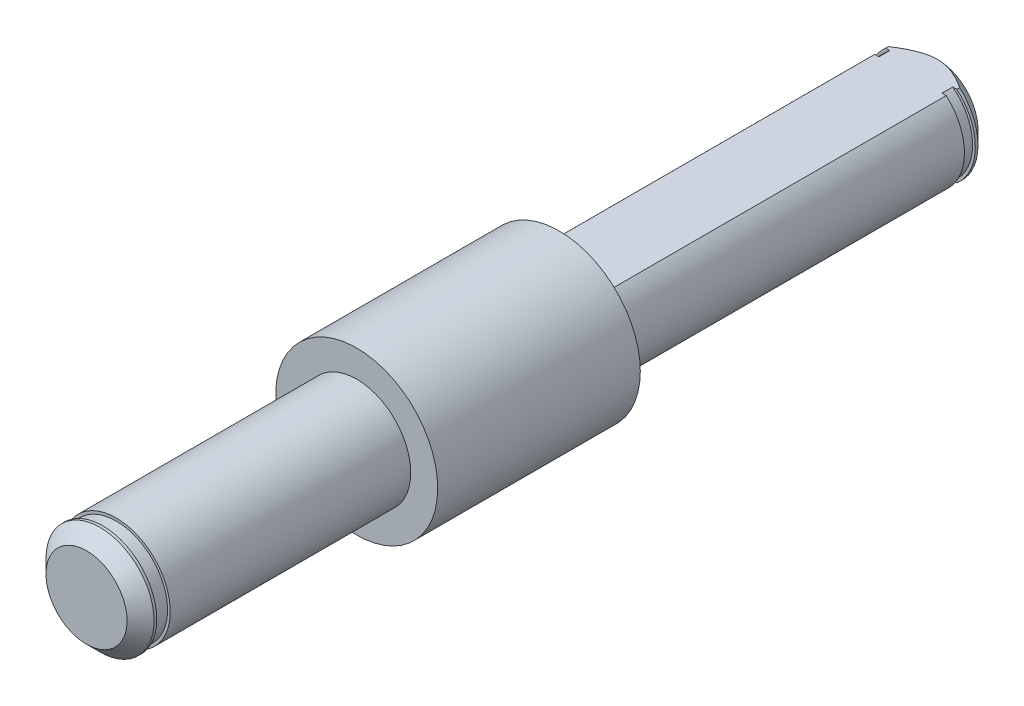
ISO-10303-21;
HEADER;
FILE_DESCRIPTION(('STEP AP214'),'2;1');
FILE_NAME('part.step','',(''),(''),'','','');
FILE_SCHEMA(('AUTOMOTIVE_DESIGN { 1 0 10303 214 1 1 1 1 }'));
ENDSEC;
DATA;
#1=APPLICATION_CONTEXT('core data for automotive mechanical design processes');
#2=APPLICATION_PROTOCOL_DEFINITION('international standard','automotive_design',2000,#1);
#3=PRODUCT_CONTEXT('',#1,'mechanical');
#4=PRODUCT('Part','Part','',(#3));
#5=PRODUCT_RELATED_PRODUCT_CATEGORY('part','',(#4));
#6=PRODUCT_DEFINITION_FORMATION('','',#4);
#7=PRODUCT_DEFINITION_CONTEXT('part definition',#1,'design');
#8=PRODUCT_DEFINITION('design','',#6,#7);
#9=PRODUCT_DEFINITION_SHAPE('','',#8);
#10=(LENGTH_UNIT() NAMED_UNIT(*) SI_UNIT(.MILLI.,.METRE.));
#11=(NAMED_UNIT(*) PLANE_ANGLE_UNIT() SI_UNIT($,.RADIAN.));
#12=(NAMED_UNIT(*) SI_UNIT($,.STERADIAN.) SOLID_ANGLE_UNIT());
#13=UNCERTAINTY_MEASURE_WITH_UNIT(LENGTH_MEASURE(1.E-05),#10,'distance_accuracy_value','');
#14=(GEOMETRIC_REPRESENTATION_CONTEXT(3) GLOBAL_UNCERTAINTY_ASSIGNED_CONTEXT((#13)) GLOBAL_UNIT_ASSIGNED_CONTEXT((#10,
#11,#12)) REPRESENTATION_CONTEXT('',''));
#15=CARTESIAN_POINT('',(0.,0.,0.));
#16=DIRECTION('',(0.,0.,1.));
#17=DIRECTION('',(1.,0.,0.));
#18=AXIS2_PLACEMENT_3D('',#15,#16,#17);
#19=CARTESIAN_POINT('',(0.,0.,-14.));
#20=DIRECTION('',(0.,0.,1.));
#21=DIRECTION('',(1.,0.,0.));
#22=AXIS2_PLACEMENT_3D('',#19,#20,#21);
#23=CYLINDRICAL_SURFACE('',#22,2.);
#24=CARTESIAN_POINT('',(0.,0.,-13.4));
#25=DIRECTION('',(0.,0.,1.));
#26=DIRECTION('',(1.,0.,0.));
#27=AXIS2_PLACEMENT_3D('',#24,#25,#26);
#28=CIRCLE('',#27,2.);
#29=CARTESIAN_POINT('',(-1.32287565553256,1.5,-13.4));
#30=VERTEX_POINT('',#29);
#31=CARTESIAN_POINT('',(-1.32287565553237,-1.49999999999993,-13.4));
#32=VERTEX_POINT('',#31);
#33=EDGE_CURVE('E343',#30,#32,#28,.T.);
#34=ORIENTED_EDGE('',*,*,#33,.F.);
#35=DIRECTION('',(0.,0.,1.));
#36=VECTOR('',#35,1.);
#37=CARTESIAN_POINT('',(-1.3228756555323,1.5,-14.));
#38=LINE('',#37,#36);
#39=CARTESIAN_POINT('',(-1.32287565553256,1.5,-13.4999999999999));
#40=VERTEX_POINT('',#39);
#41=EDGE_CURVE('E359',#40,#30,#38,.T.);
#42=ORIENTED_EDGE('',*,*,#41,.F.);
#43=CARTESIAN_POINT('',(0.,0.,-13.5));
#44=DIRECTION('',(0.,0.,-1.));
#45=DIRECTION('',(-1.,0.,0.));
#46=AXIS2_PLACEMENT_3D('',#43,#44,#45);
#47=CIRCLE('',#46,2.);
#48=CARTESIAN_POINT('',(-1.3228756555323,-1.5,-13.5));
#49=VERTEX_POINT('',#48);
#50=EDGE_CURVE('E270',#40,#49,#47,.F.);
#51=ORIENTED_EDGE('',*,*,#50,.T.);
#52=DIRECTION('',(0.,0.,1.));
#53=VECTOR('',#52,1.);
#54=CARTESIAN_POINT('',(-1.3228756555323,-1.5,-14.));
#55=LINE('',#54,#53);
#56=EDGE_CURVE('E350',#32,#49,#55,.F.);
#57=ORIENTED_EDGE('',*,*,#56,.F.);
#58=EDGE_LOOP('',(#34,#42,#51,#57));
#59=FACE_BOUND('',#58,.T.);
#60=ADVANCED_FACE('F33',(#59),#23,.T.);
#61=CARTESIAN_POINT('',(0.,0.,-13.));
#62=DIRECTION('',(0.,0.,-1.));
#63=DIRECTION('',(-1.,0.,0.));
#64=AXIS2_PLACEMENT_3D('',#61,#62,#63);
#65=CIRCLE('',#64,2.);
#66=CARTESIAN_POINT('',(-1.32287565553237,-1.49999999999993,-13.));
#67=VERTEX_POINT('',#66);
#68=CARTESIAN_POINT('',(-1.3228756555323,1.5,-13.));
#69=VERTEX_POINT('',#68);
#70=EDGE_CURVE('E57',#67,#69,#65,.T.);
#71=ORIENTED_EDGE('',*,*,#70,.F.);
#72=CARTESIAN_POINT('',(-1.32287565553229,-1.5,0.));
#73=VERTEX_POINT('',#72);
#74=EDGE_CURVE('E351',#73,#67,#55,.F.);
#75=ORIENTED_EDGE('',*,*,#74,.F.);
#76=CARTESIAN_POINT('',(0.,0.,0.));
#77=DIRECTION('',(0.,0.,1.));
#78=DIRECTION('',(1.,0.,0.));
#79=AXIS2_PLACEMENT_3D('',#76,#77,#78);
#80=CIRCLE('',#79,2.);
#81=CARTESIAN_POINT('',(-1.32287565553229,1.5,0.));
#82=VERTEX_POINT('',#81);
#83=EDGE_CURVE('E267',#73,#82,#80,.F.);
#84=ORIENTED_EDGE('',*,*,#83,.T.);
#85=EDGE_CURVE('E358',#69,#82,#38,.T.);
#86=ORIENTED_EDGE('',*,*,#85,.F.);
#87=EDGE_LOOP('',(#71,#75,#84,#86));
#88=FACE_BOUND('',#87,.T.);
#89=ADVANCED_FACE('F188',(#88),#23,.T.);
#90=CARTESIAN_POINT('',(0.,0.,-13.4));
#91=DIRECTION('',(0.,0.,1.));
#92=DIRECTION('',(1.,0.,0.));
#93=AXIS2_PLACEMENT_3D('',#90,#91,#92);
#94=CIRCLE('',#93,2.);
#95=CARTESIAN_POINT('',(1.3228756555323,-1.5,-13.4));
#96=VERTEX_POINT('',#95);
#97=CARTESIAN_POINT('',(1.3228756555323,1.5,-13.4));
#98=VERTEX_POINT('',#97);
#99=EDGE_CURVE('E339',#96,#98,#94,.T.);
#100=ORIENTED_EDGE('',*,*,#99,.F.);
#101=DIRECTION('',(0.,0.,1.));
#102=VECTOR('',#101,1.);
#103=CARTESIAN_POINT('',(1.3228756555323,-1.5,-14.));
#104=LINE('',#103,#102);
#105=CARTESIAN_POINT('',(1.3228756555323,-1.5,-13.5));
#106=VERTEX_POINT('',#105);
#107=EDGE_CURVE('E354',#106,#96,#104,.T.);
#108=ORIENTED_EDGE('',*,*,#107,.F.);
#109=CARTESIAN_POINT('',(1.3228756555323,1.5,-13.5));
#110=VERTEX_POINT('',#109);
#111=EDGE_CURVE('E273',#106,#110,#47,.F.);
#112=ORIENTED_EDGE('',*,*,#111,.T.);
#113=DIRECTION('',(0.,0.,1.));
#114=VECTOR('',#113,1.);
#115=CARTESIAN_POINT('',(1.3228756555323,1.5,-14.));
#116=LINE('',#115,#114);
#117=EDGE_CURVE('E356',#98,#110,#116,.F.);
#118=ORIENTED_EDGE('',*,*,#117,.F.);
#119=EDGE_LOOP('',(#100,#108,#112,#118));
#120=FACE_BOUND('',#119,.T.);
#121=ADVANCED_FACE('F184',(#120),#23,.T.);
#122=CARTESIAN_POINT('',(0.,0.,-13.));
#123=DIRECTION('',(0.,0.,-1.));
#124=DIRECTION('',(-1.,0.,0.));
#125=AXIS2_PLACEMENT_3D('',#122,#123,#124);
#126=CIRCLE('',#125,2.);
#127=CARTESIAN_POINT('',(1.3228756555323,1.5,-13.));
#128=VERTEX_POINT('',#127);
#129=CARTESIAN_POINT('',(1.3228756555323,-1.5,-13.));
#130=VERTEX_POINT('',#129);
#131=EDGE_CURVE('E326',#128,#130,#126,.T.);
#132=ORIENTED_EDGE('',*,*,#131,.F.);
#133=CARTESIAN_POINT('',(1.3228756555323,1.5,0.));
#134=VERTEX_POINT('',#133);
#135=EDGE_CURVE('E324',#134,#128,#116,.F.);
#136=ORIENTED_EDGE('',*,*,#135,.F.);
#137=CARTESIAN_POINT('',(1.3228756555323,-1.5,0.));
#138=VERTEX_POINT('',#137);
#139=EDGE_CURVE('E262',#134,#138,#80,.F.);
#140=ORIENTED_EDGE('',*,*,#139,.T.);
#141=EDGE_CURVE('E330',#130,#138,#104,.T.);
#142=ORIENTED_EDGE('',*,*,#141,.F.);
#143=EDGE_LOOP('',(#132,#136,#140,#142));
#144=FACE_BOUND('',#143,.T.);
#145=ADVANCED_FACE('F179',(#144),#23,.T.);
#146=CARTESIAN_POINT('',(2.318358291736,-1.5,0.));
#147=DIRECTION('',(0.,-1.,0.));
#148=DIRECTION('',(0.,0.,-1.));
#149=AXIS2_PLACEMENT_3D('',#146,#147,#148);
#150=PLANE('',#149);
#151=DIRECTION('',(0.,0.,1.));
#152=VECTOR('',#151,1.);
#153=CARTESIAN_POINT('',(-1.16619037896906,-1.5,0.));
#154=LINE('',#153,#152);
#155=CARTESIAN_POINT('',(-1.16619037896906,-1.5,-13.));
#156=VERTEX_POINT('',#155);
#157=CARTESIAN_POINT('',(-1.16619037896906,-1.5,-13.4));
#158=VERTEX_POINT('',#157);
#159=EDGE_CURVE('E144',#156,#158,#154,.F.);
#160=ORIENTED_EDGE('',*,*,#159,.T.);
#161=DIRECTION('',(-1.,0.,0.));
#162=VECTOR('',#161,1.);
#163=CARTESIAN_POINT('',(2.318358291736,-1.5,-13.4));
#164=LINE('',#163,#162);
#165=EDGE_CURVE('E344',#158,#32,#164,.T.);
#166=ORIENTED_EDGE('',*,*,#165,.T.);
#167=ORIENTED_EDGE('',*,*,#56,.T.);
#168=CARTESIAN_POINT('',(-2.91383447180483,-1.5,-12.2227402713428));
#169=CARTESIAN_POINT('',(-2.84632281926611,-1.5,-12.282755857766));
#170=CARTESIAN_POINT('',(-2.77860211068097,-1.5,-12.3425385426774));
#171=CARTESIAN_POINT('',(-2.64263139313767,-1.5,-12.4615133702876));
#172=CARTESIAN_POINT('',(-2.57438132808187,-1.5,-12.5207054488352));
#173=CARTESIAN_POINT('',(-2.43695412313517,-1.5,-12.6386196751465));
#174=CARTESIAN_POINT('',(-2.36777422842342,-1.5,-12.6973386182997));
#175=CARTESIAN_POINT('',(-2.22864291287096,-1.5,-12.8138499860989));
#176=CARTESIAN_POINT('',(-2.15869152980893,-1.5,-12.871642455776));
#177=CARTESIAN_POINT('',(-2.01369677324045,-1.5,-12.9894064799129));
#178=CARTESIAN_POINT('',(-1.93859546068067,-1.5,-13.0493069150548));
#179=CARTESIAN_POINT('',(-1.78703130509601,-1.5,-13.1673579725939));
#180=CARTESIAN_POINT('',(-1.71056855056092,-1.5,-13.2255087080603));
#181=CARTESIAN_POINT('',(-1.55602138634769,-1.5,-13.339335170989));
#182=CARTESIAN_POINT('',(-1.47794006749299,-1.5,-13.3950150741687));
#183=CARTESIAN_POINT('',(-1.31952631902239,-1.5,-13.5030563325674));
#184=CARTESIAN_POINT('',(-1.2391947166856,-1.5,-13.5554188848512));
#185=CARTESIAN_POINT('',(-1.10052560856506,-1.5,-13.6401240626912));
#186=CARTESIAN_POINT('',(-1.0429476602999,-1.5,-13.673703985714));
#187=CARTESIAN_POINT('',(-0.926084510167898,-1.5,-13.7378300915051));
#188=CARTESIAN_POINT('',(-0.8667987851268,-1.5,-13.7683753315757));
#189=CARTESIAN_POINT('',(-0.746799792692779,-1.5,-13.8252042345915));
#190=CARTESIAN_POINT('',(-0.68610250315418,-1.5,-13.8515212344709));
#191=CARTESIAN_POINT('',(-0.56269741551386,-1.5,-13.8989401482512));
#192=CARTESIAN_POINT('',(-0.49999091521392,-1.5,-13.9200453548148));
#193=CARTESIAN_POINT('',(-0.392743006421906,-1.5,-13.9500019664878));
#194=CARTESIAN_POINT('',(-0.348695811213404,-1.5,-13.960619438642));
#195=CARTESIAN_POINT('',(-0.259894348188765,-1.5,-13.9782725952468));
#196=CARTESIAN_POINT('',(-0.215140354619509,-1.5,-13.9853096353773));
#197=CARTESIAN_POINT('',(-0.125302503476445,-1.5,-13.9954352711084));
#198=CARTESIAN_POINT('',(-0.080219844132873,-1.5,-13.9985343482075));
#199=CARTESIAN_POINT('',(0.0100433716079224,-1.5,-14.0006449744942));
#200=CARTESIAN_POINT('',(0.0552239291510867,-1.5,-13.9996564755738));
#201=CARTESIAN_POINT('',(0.145226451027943,-1.5,-13.9936542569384));
#202=CARTESIAN_POINT('',(0.190048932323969,-1.5,-13.9886481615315));
#203=CARTESIAN_POINT('',(0.27911642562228,-1.5,-13.9748874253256));
#204=CARTESIAN_POINT('',(0.323361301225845,-1.5,-13.9661319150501));
#205=CARTESIAN_POINT('',(0.411210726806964,-1.5,-13.9452444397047));
#206=CARTESIAN_POINT('',(0.45481228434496,-1.5,-13.9331000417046));
#207=CARTESIAN_POINT('',(0.541090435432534,-1.5,-13.9059155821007));
#208=CARTESIAN_POINT('',(0.583767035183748,-1.5,-13.8908755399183));
#209=CARTESIAN_POINT('',(0.736564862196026,-1.5,-13.8320457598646));
#210=CARTESIAN_POINT('',(0.843947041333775,-1.5,-13.7811522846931));
#211=CARTESIAN_POINT('',(1.05333291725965,-1.5,-13.6692461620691));
#212=CARTESIAN_POINT('',(1.15532294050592,-1.5,-13.6082092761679));
#213=CARTESIAN_POINT('',(1.35668988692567,-1.5,-13.4789646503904));
#214=CARTESIAN_POINT('',(1.45600815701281,-1.5,-13.4106664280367));
#215=CARTESIAN_POINT('',(1.60265082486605,-1.5,-13.3051525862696));
#216=CARTESIAN_POINT('',(1.65111611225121,-1.5,-13.2694910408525));
#217=CARTESIAN_POINT('',(1.74740058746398,-1.5,-13.1973074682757));
#218=CARTESIAN_POINT('',(1.79521979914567,-1.5,-13.1607854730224));
#219=CARTESIAN_POINT('',(1.95618427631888,-1.5,-13.035958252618));
#220=CARTESIAN_POINT('',(2.06805306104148,-1.5,-12.9460090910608));
#221=CARTESIAN_POINT('',(2.2896345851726,-1.5,-12.7634860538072));
#222=CARTESIAN_POINT('',(2.39934702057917,-1.5,-12.6709118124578));
#223=CARTESIAN_POINT('',(2.61724618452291,-1.5,-12.483901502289));
#224=CARTESIAN_POINT('',(2.72543228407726,-1.5,-12.3894647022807));
#225=CARTESIAN_POINT('',(2.94063718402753,-1.5,-12.1992684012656));
#226=CARTESIAN_POINT('',(3.04765595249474,-1.5,-12.1035088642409));
#227=CARTESIAN_POINT('',(3.36781602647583,-1.5,-11.8143950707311));
#228=CARTESIAN_POINT('',(3.57963413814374,-1.5,-11.6195772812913));
#229=CARTESIAN_POINT('',(4.00106848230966,-1.5,-11.2276899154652));
#230=CARTESIAN_POINT('',(4.21068523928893,-1.5,-11.0306208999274));
#231=CARTESIAN_POINT('',(4.60383939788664,-1.5,-10.6583223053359));
#232=CARTESIAN_POINT('',(4.78753524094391,-1.5,-10.4832598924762));
#233=CARTESIAN_POINT('',(5.15413935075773,-1.5,-10.1322856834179));
#234=CARTESIAN_POINT('',(5.33704755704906,-1.5,-9.95637382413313));
#235=CARTESIAN_POINT('',(5.70165470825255,-1.5,-9.60452884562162));
#236=CARTESIAN_POINT('',(5.88335565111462,-1.5,-9.42859779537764));
#237=CARTESIAN_POINT('',(6.24628302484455,-1.5,-9.07627777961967));
#238=CARTESIAN_POINT('',(6.42750949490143,-1.5,-8.89988885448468));
#239=CARTESIAN_POINT('',(6.60857193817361,-1.5,-8.72333245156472));
#240=B_SPLINE_CURVE_WITH_KNOTS('',3,(#168,#169,#170,#171,#172,#173,#174,#175,#176,#177,#178,
#179,#180,#181,#182,#183,#184,#185,#186,#187,#188,#189,#190,#191,#192,#193,#194,#195,#196,#197,
#198,#199,#200,#201,#202,#203,#204,#205,#206,#207,#208,#209,#210,#211,#212,#213,#214,#215,#216,
#217,#218,#219,#220,#221,#222,#223,#224,#225,#226,#227,#228,#229,#230,#231,#232,#233,#234,#235,
#236,#237,#238,#239),.UNSPECIFIED.,.F.,.F.,(4,2,2,2,2,2,2,2,2,2,2,2,2,2,2,2,2,2,2,2,2,2,2,2,2,2,
2,2,2,2,2,2,2,2,2,4),(0.,0.270994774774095,0.542018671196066,0.814232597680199,1.08643325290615,
1.3746059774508,1.66276003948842,1.95040697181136,2.23794950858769,2.43784579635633,
2.63780398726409,2.83609879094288,3.03426799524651,3.17006813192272,3.30581681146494,
3.44120341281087,3.57659160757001,3.71172347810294,3.84688670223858,3.98255247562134,
4.11821733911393,4.47365712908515,4.82995881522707,5.1913832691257,5.37189350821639,
5.55239706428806,5.98296540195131,6.41359401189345,6.84439517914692,7.27520810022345,
8.13853180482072,9.0016449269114,9.76290262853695,10.5242177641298,11.2829675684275,
12.0416525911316),.UNSPECIFIED.);
#241=CARTESIAN_POINT('',(0.,-1.5,-14.));
#242=VERTEX_POINT('',#241);
#243=EDGE_CURVE('E162',#242,#49,#240,.F.);
#244=ORIENTED_EDGE('',*,*,#243,.F.);
#245=EDGE_CURVE('E161',#106,#242,#240,.F.);
#246=ORIENTED_EDGE('',*,*,#245,.F.);
#247=ORIENTED_EDGE('',*,*,#107,.T.);
#248=CARTESIAN_POINT('',(1.16619037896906,-1.5,-13.4));
#249=VERTEX_POINT('',#248);
#250=EDGE_CURVE('E341',#96,#249,#164,.T.);
#251=ORIENTED_EDGE('',*,*,#250,.T.);
#252=DIRECTION('',(0.,0.,1.));
#253=VECTOR('',#252,1.);
#254=CARTESIAN_POINT('',(1.16619037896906,-1.5,0.));
#255=LINE('',#254,#253);
#256=CARTESIAN_POINT('',(1.16619037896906,-1.5,-13.));
#257=VERTEX_POINT('',#256);
#258=EDGE_CURVE('E318',#249,#257,#255,.T.);
#259=ORIENTED_EDGE('',*,*,#258,.T.);
#260=DIRECTION('',(1.,0.,0.));
#261=VECTOR('',#260,1.);
#262=CARTESIAN_POINT('',(2.318358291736,-1.5,-13.));
#263=LINE('',#262,#261);
#264=EDGE_CURVE('E331',#257,#130,#263,.T.);
#265=ORIENTED_EDGE('',*,*,#264,.T.);
#266=ORIENTED_EDGE('',*,*,#141,.T.);
#267=DIRECTION('',(-1.,0.,0.));
#268=VECTOR('',#267,1.);
#269=CARTESIAN_POINT('',(2.318358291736,-1.5,0.));
#270=LINE('',#269,#268);
#271=EDGE_CURVE('E346',#138,#73,#270,.T.);
#272=ORIENTED_EDGE('',*,*,#271,.T.);
#273=ORIENTED_EDGE('',*,*,#74,.T.);
#274=EDGE_CURVE('E332',#67,#156,#263,.T.);
#275=ORIENTED_EDGE('',*,*,#274,.T.);
#276=EDGE_LOOP('',(#160,#166,#167,#244,#246,#247,#251,#259,#265,#266,#272,#273,#275));
#277=FACE_BOUND('',#276,.T.);
#278=ADVANCED_FACE('F174',(#277),#150,.T.);
#279=CARTESIAN_POINT('',(2.318358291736,1.5,0.));
#280=DIRECTION('',(0.,1.,0.));
#281=DIRECTION('',(0.,0.,1.));
#282=AXIS2_PLACEMENT_3D('',#279,#280,#281);
#283=PLANE('',#282);
#284=DIRECTION('',(0.,0.,1.));
#285=VECTOR('',#284,1.);
#286=CARTESIAN_POINT('',(1.16619037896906,1.5,0.));
#287=LINE('',#286,#285);
#288=CARTESIAN_POINT('',(1.16619037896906,1.5,-13.));
#289=VERTEX_POINT('',#288);
#290=CARTESIAN_POINT('',(1.16619037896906,1.5,-13.4));
#291=VERTEX_POINT('',#290);
#292=EDGE_CURVE('E37',#289,#291,#287,.F.);
#293=ORIENTED_EDGE('',*,*,#292,.T.);
#294=DIRECTION('',(1.,0.,0.));
#295=VECTOR('',#294,1.);
#296=CARTESIAN_POINT('',(2.318358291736,1.5,-13.4));
#297=LINE('',#296,#295);
#298=EDGE_CURVE('E12',#291,#98,#297,.T.);
#299=ORIENTED_EDGE('',*,*,#298,.T.);
#300=ORIENTED_EDGE('',*,*,#117,.T.);
#301=CARTESIAN_POINT('',(-2.91383447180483,1.5,-12.2227402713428));
#302=CARTESIAN_POINT('',(-2.84632281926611,1.5,-12.282755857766));
#303=CARTESIAN_POINT('',(-2.77860211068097,1.5,-12.3425385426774));
#304=CARTESIAN_POINT('',(-2.64263139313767,1.5,-12.4615133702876));
#305=CARTESIAN_POINT('',(-2.57438132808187,1.5,-12.5207054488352));
#306=CARTESIAN_POINT('',(-2.43695412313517,1.5,-12.6386196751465));
#307=CARTESIAN_POINT('',(-2.36777422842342,1.5,-12.6973386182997));
#308=CARTESIAN_POINT('',(-2.22864291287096,1.5,-12.8138499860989));
#309=CARTESIAN_POINT('',(-2.15869152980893,1.5,-12.871642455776));
#310=CARTESIAN_POINT('',(-2.01369677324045,1.5,-12.9894064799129));
#311=CARTESIAN_POINT('',(-1.93859546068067,1.5,-13.0493069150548));
#312=CARTESIAN_POINT('',(-1.78703130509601,1.5,-13.1673579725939));
#313=CARTESIAN_POINT('',(-1.71056855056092,1.5,-13.2255087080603));
#314=CARTESIAN_POINT('',(-1.55602138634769,1.5,-13.339335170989));
#315=CARTESIAN_POINT('',(-1.47794006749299,1.5,-13.3950150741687));
#316=CARTESIAN_POINT('',(-1.31952631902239,1.5,-13.5030563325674));
#317=CARTESIAN_POINT('',(-1.2391947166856,1.5,-13.5554188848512));
#318=CARTESIAN_POINT('',(-1.10052560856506,1.5,-13.6401240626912));
#319=CARTESIAN_POINT('',(-1.0429476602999,1.5,-13.673703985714));
#320=CARTESIAN_POINT('',(-0.926084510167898,1.5,-13.7378300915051));
#321=CARTESIAN_POINT('',(-0.8667987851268,1.5,-13.7683753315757));
#322=CARTESIAN_POINT('',(-0.746799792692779,1.5,-13.8252042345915));
#323=CARTESIAN_POINT('',(-0.68610250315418,1.5,-13.8515212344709));
#324=CARTESIAN_POINT('',(-0.56269741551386,1.5,-13.8989401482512));
#325=CARTESIAN_POINT('',(-0.49999091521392,1.5,-13.9200453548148));
#326=CARTESIAN_POINT('',(-0.392743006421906,1.5,-13.9500019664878));
#327=CARTESIAN_POINT('',(-0.348695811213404,1.5,-13.960619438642));
#328=CARTESIAN_POINT('',(-0.259894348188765,1.5,-13.9782725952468));
#329=CARTESIAN_POINT('',(-0.215140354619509,1.5,-13.9853096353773));
#330=CARTESIAN_POINT('',(-0.125302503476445,1.5,-13.9954352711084));
#331=CARTESIAN_POINT('',(-0.080219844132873,1.5,-13.9985343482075));
#332=CARTESIAN_POINT('',(0.0100433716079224,1.5,-14.0006449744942));
#333=CARTESIAN_POINT('',(0.0552239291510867,1.5,-13.9996564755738));
#334=CARTESIAN_POINT('',(0.145226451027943,1.5,-13.9936542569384));
#335=CARTESIAN_POINT('',(0.190048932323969,1.5,-13.9886481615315));
#336=CARTESIAN_POINT('',(0.27911642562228,1.5,-13.9748874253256));
#337=CARTESIAN_POINT('',(0.323361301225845,1.5,-13.9661319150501));
#338=CARTESIAN_POINT('',(0.411210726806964,1.5,-13.9452444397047));
#339=CARTESIAN_POINT('',(0.45481228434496,1.5,-13.9331000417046));
#340=CARTESIAN_POINT('',(0.541090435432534,1.5,-13.9059155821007));
#341=CARTESIAN_POINT('',(0.583767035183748,1.5,-13.8908755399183));
#342=CARTESIAN_POINT('',(0.736564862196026,1.5,-13.8320457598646));
#343=CARTESIAN_POINT('',(0.843947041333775,1.5,-13.7811522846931));
#344=CARTESIAN_POINT('',(1.05333291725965,1.5,-13.6692461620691));
#345=CARTESIAN_POINT('',(1.15532294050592,1.5,-13.6082092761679));
#346=CARTESIAN_POINT('',(1.35668988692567,1.5,-13.4789646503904));
#347=CARTESIAN_POINT('',(1.45600815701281,1.5,-13.4106664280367));
#348=CARTESIAN_POINT('',(1.60265082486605,1.5,-13.3051525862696));
#349=CARTESIAN_POINT('',(1.65111611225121,1.5,-13.2694910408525));
#350=CARTESIAN_POINT('',(1.74740058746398,1.5,-13.1973074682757));
#351=CARTESIAN_POINT('',(1.79521979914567,1.5,-13.1607854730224));
#352=CARTESIAN_POINT('',(1.95618427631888,1.5,-13.035958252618));
#353=CARTESIAN_POINT('',(2.06805306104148,1.5,-12.9460090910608));
#354=CARTESIAN_POINT('',(2.2896345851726,1.5,-12.7634860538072));
#355=CARTESIAN_POINT('',(2.39934702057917,1.5,-12.6709118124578));
#356=CARTESIAN_POINT('',(2.61724618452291,1.5,-12.483901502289));
#357=CARTESIAN_POINT('',(2.72543228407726,1.5,-12.3894647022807));
#358=CARTESIAN_POINT('',(2.94063718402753,1.5,-12.1992684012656));
#359=CARTESIAN_POINT('',(3.04765595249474,1.5,-12.1035088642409));
#360=CARTESIAN_POINT('',(3.36781602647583,1.5,-11.8143950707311));
#361=CARTESIAN_POINT('',(3.57963413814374,1.5,-11.6195772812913));
#362=CARTESIAN_POINT('',(4.00106848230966,1.5,-11.2276899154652));
#363=CARTESIAN_POINT('',(4.21068523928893,1.5,-11.0306208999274));
#364=CARTESIAN_POINT('',(4.60383939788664,1.5,-10.6583223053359));
#365=CARTESIAN_POINT('',(4.78753524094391,1.5,-10.4832598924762));
#366=CARTESIAN_POINT('',(5.15413935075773,1.5,-10.1322856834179));
#367=CARTESIAN_POINT('',(5.33704755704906,1.5,-9.95637382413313));
#368=CARTESIAN_POINT('',(5.70165470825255,1.5,-9.60452884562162));
#369=CARTESIAN_POINT('',(5.88335565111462,1.5,-9.42859779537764));
#370=CARTESIAN_POINT('',(6.24628302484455,1.5,-9.07627777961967));
#371=CARTESIAN_POINT('',(6.42750949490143,1.5,-8.89988885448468));
#372=CARTESIAN_POINT('',(6.60857193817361,1.5,-8.72333245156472));
#373=B_SPLINE_CURVE_WITH_KNOTS('',3,(#301,#302,#303,#304,#305,#306,#307,#308,#309,#310,#311,
#312,#313,#314,#315,#316,#317,#318,#319,#320,#321,#322,#323,#324,#325,#326,#327,#328,#329,#330,
#331,#332,#333,#334,#335,#336,#337,#338,#339,#340,#341,#342,#343,#344,#345,#346,#347,#348,#349,
#350,#351,#352,#353,#354,#355,#356,#357,#358,#359,#360,#361,#362,#363,#364,#365,#366,#367,#368,
#369,#370,#371,#372),.UNSPECIFIED.,.F.,.F.,(4,2,2,2,2,2,2,2,2,2,2,2,2,2,2,2,2,2,2,2,2,2,2,2,2,2,
2,2,2,2,2,2,2,2,2,4),(0.,0.270994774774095,0.542018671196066,0.814232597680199,1.08643325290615,
1.3746059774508,1.66276003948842,1.95040697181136,2.23794950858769,2.43784579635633,
2.63780398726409,2.83609879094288,3.03426799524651,3.17006813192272,3.30581681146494,
3.44120341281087,3.57659160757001,3.71172347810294,3.84688670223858,3.98255247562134,
4.11821733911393,4.47365712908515,4.82995881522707,5.1913832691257,5.37189350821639,
5.55239706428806,5.98296540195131,6.41359401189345,6.84439517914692,7.27520810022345,
8.13853180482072,9.0016449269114,9.76290262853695,10.5242177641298,11.2829675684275,
12.0416525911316),.UNSPECIFIED.);
#374=CARTESIAN_POINT('',(0.,1.5,-14.));
#375=VERTEX_POINT('',#374);
#376=EDGE_CURVE('E153',#375,#110,#373,.T.);
#377=ORIENTED_EDGE('',*,*,#376,.F.);
#378=EDGE_CURVE('E136',#40,#375,#373,.T.);
#379=ORIENTED_EDGE('',*,*,#378,.F.);
#380=ORIENTED_EDGE('',*,*,#41,.T.);
#381=CARTESIAN_POINT('',(-1.16619037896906,1.5,-13.4));
#382=VERTEX_POINT('',#381);
#383=EDGE_CURVE('E42',#30,#382,#297,.T.);
#384=ORIENTED_EDGE('',*,*,#383,.T.);
#385=DIRECTION('',(0.,0.,1.));
#386=VECTOR('',#385,1.);
#387=CARTESIAN_POINT('',(-1.16619037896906,1.5,0.));
#388=LINE('',#387,#386);
#389=CARTESIAN_POINT('',(-1.16619037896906,1.5,-13.));
#390=VERTEX_POINT('',#389);
#391=EDGE_CURVE('E135',#382,#390,#388,.T.);
#392=ORIENTED_EDGE('',*,*,#391,.T.);
#393=DIRECTION('',(-1.,0.,0.));
#394=VECTOR('',#393,1.);
#395=CARTESIAN_POINT('',(2.318358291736,1.5,-13.));
#396=LINE('',#395,#394);
#397=EDGE_CURVE('E127',#390,#69,#396,.T.);
#398=ORIENTED_EDGE('',*,*,#397,.T.);
#399=ORIENTED_EDGE('',*,*,#85,.T.);
#400=DIRECTION('',(1.,0.,0.));
#401=VECTOR('',#400,1.);
#402=CARTESIAN_POINT('',(2.318358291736,1.5,0.));
#403=LINE('',#402,#401);
#404=EDGE_CURVE('E348',#82,#134,#403,.T.);
#405=ORIENTED_EDGE('',*,*,#404,.T.);
#406=ORIENTED_EDGE('',*,*,#135,.T.);
#407=EDGE_CURVE('E138',#128,#289,#396,.T.);
#408=ORIENTED_EDGE('',*,*,#407,.T.);
#409=EDGE_LOOP('',(#293,#299,#300,#377,#379,#380,#384,#392,#398,#399,#405,#406,#408));
#410=FACE_BOUND('',#409,.T.);
#411=ADVANCED_FACE('F149',(#410),#283,.T.);
#412=CARTESIAN_POINT('',(0.,0.,-14.));
#413=DIRECTION('',(0.,0.,1.));
#414=DIRECTION('',(1.,0.,0.));
#415=AXIS2_PLACEMENT_3D('',#412,#413,#414);
#416=CONICAL_SURFACE('',#415,1.5,0.785398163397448);
#417=ORIENTED_EDGE('',*,*,#50,.F.);
#418=ORIENTED_EDGE('',*,*,#378,.T.);
#419=CARTESIAN_POINT('',(0.,0.,-14.));
#420=DIRECTION('',(0.,0.,-1.));
#421=DIRECTION('',(-1.,0.,0.));
#422=AXIS2_PLACEMENT_3D('',#419,#420,#421);
#423=CIRCLE('',#422,1.5);
#424=EDGE_CURVE('E271',#242,#375,#423,.T.);
#425=ORIENTED_EDGE('',*,*,#424,.F.);
#426=ORIENTED_EDGE('',*,*,#243,.T.);
#427=EDGE_LOOP('',(#417,#418,#425,#426));
#428=FACE_BOUND('',#427,.T.);
#429=ADVANCED_FACE('F168',(#428),#416,.T.);
#430=EDGE_CURVE('E268',#375,#242,#423,.T.);
#431=ORIENTED_EDGE('',*,*,#430,.F.);
#432=ORIENTED_EDGE('',*,*,#376,.T.);
#433=ORIENTED_EDGE('',*,*,#111,.F.);
#434=ORIENTED_EDGE('',*,*,#245,.T.);
#435=EDGE_LOOP('',(#431,#432,#433,#434));
#436=FACE_BOUND('',#435,.T.);
#437=ADVANCED_FACE('F224',(#436),#416,.T.);
#438=CARTESIAN_POINT('',(0.,0.,0.));
#439=DIRECTION('',(0.,0.,1.));
#440=DIRECTION('',(1.,0.,0.));
#441=AXIS2_PLACEMENT_3D('',#438,#439,#440);
#442=PLANE('',#441);
#443=ORIENTED_EDGE('',*,*,#139,.F.);
#444=ORIENTED_EDGE('',*,*,#404,.F.);
#445=ORIENTED_EDGE('',*,*,#83,.F.);
#446=ORIENTED_EDGE('',*,*,#271,.F.);
#447=EDGE_LOOP('',(#443,#444,#445,#446));
#448=FACE_BOUND('',#447,.T.);
#449=CARTESIAN_POINT('',(0.,0.,0.));
#450=DIRECTION('',(0.,0.,1.));
#451=DIRECTION('',(1.,0.,0.));
#452=AXIS2_PLACEMENT_3D('',#449,#450,#451);
#453=CIRCLE('',#452,3.);
#454=CARTESIAN_POINT('',(3.,0.,0.));
#455=VERTEX_POINT('',#454);
#456=EDGE_CURVE('E243',#455,#455,#453,.T.);
#457=ORIENTED_EDGE('',*,*,#456,.F.);
#458=EDGE_LOOP('',(#457));
#459=FACE_BOUND('',#458,.T.);
#460=ADVANCED_FACE('F222',(#448,#459),#442,.F.);
#461=CARTESIAN_POINT('',(0.,0.,17.5));
#462=DIRECTION('',(0.,0.,-1.));
#463=DIRECTION('',(-1.,0.,0.));
#464=AXIS2_PLACEMENT_3D('',#461,#462,#463);
#465=CYLINDRICAL_SURFACE('',#464,2.);
#466=CARTESIAN_POINT('',(0.,0.,16.4));
#467=DIRECTION('',(0.,0.,-1.));
#468=DIRECTION('',(-1.,0.,0.));
#469=AXIS2_PLACEMENT_3D('',#466,#467,#468);
#470=CIRCLE('',#469,2.);
#471=CARTESIAN_POINT('',(-2.,0.,16.4));
#472=VERTEX_POINT('',#471);
#473=EDGE_CURVE('E244',#472,#472,#470,.T.);
#474=ORIENTED_EDGE('',*,*,#473,.T.);
#475=EDGE_LOOP('',(#474));
#476=FACE_BOUND('',#475,.T.);
#477=CARTESIAN_POINT('',(0.,0.,7.5));
#478=DIRECTION('',(0.,0.,1.));
#479=DIRECTION('',(1.,0.,0.));
#480=AXIS2_PLACEMENT_3D('',#477,#478,#479);
#481=CIRCLE('',#480,2.);
#482=CARTESIAN_POINT('',(2.,0.,7.5));
#483=VERTEX_POINT('',#482);
#484=EDGE_CURVE('E241',#483,#483,#481,.T.);
#485=ORIENTED_EDGE('',*,*,#484,.T.);
#486=EDGE_LOOP('',(#485));
#487=FACE_BOUND('',#486,.T.);
#488=ADVANCED_FACE('F221',(#476,#487),#465,.T.);
#489=CARTESIAN_POINT('',(0.,0.,7.5));
#490=DIRECTION('',(0.,0.,1.));
#491=DIRECTION('',(1.,0.,0.));
#492=AXIS2_PLACEMENT_3D('',#489,#490,#491);
#493=PLANE('',#492);
#494=CARTESIAN_POINT('',(0.,0.,7.5));
#495=DIRECTION('',(0.,0.,1.));
#496=DIRECTION('',(1.,0.,0.));
#497=AXIS2_PLACEMENT_3D('',#494,#495,#496);
#498=CIRCLE('',#497,3.);
#499=CARTESIAN_POINT('',(3.,0.,7.5));
#500=VERTEX_POINT('',#499);
#501=EDGE_CURVE('E238',#500,#500,#498,.T.);
#502=ORIENTED_EDGE('',*,*,#501,.T.);
#503=EDGE_LOOP('',(#502));
#504=FACE_BOUND('',#503,.T.);
#505=ORIENTED_EDGE('',*,*,#484,.F.);
#506=EDGE_LOOP('',(#505));
#507=FACE_BOUND('',#506,.T.);
#508=ADVANCED_FACE('F226',(#504,#507),#493,.T.);
#509=CARTESIAN_POINT('',(0.,0.,7.5));
#510=DIRECTION('',(0.,0.,-1.));
#511=DIRECTION('',(-1.,0.,0.));
#512=AXIS2_PLACEMENT_3D('',#509,#510,#511);
#513=CYLINDRICAL_SURFACE('',#512,3.);
#514=ORIENTED_EDGE('',*,*,#501,.F.);
#515=EDGE_LOOP('',(#514));
#516=FACE_BOUND('',#515,.T.);
#517=ORIENTED_EDGE('',*,*,#456,.T.);
#518=EDGE_LOOP('',(#517));
#519=FACE_BOUND('',#518,.T.);
#520=ADVANCED_FACE('F35',(#516,#519),#513,.T.);
#521=CARTESIAN_POINT('',(0.,2.43754096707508,16.4));
#522=DIRECTION('',(0.,0.,-1.));
#523=DIRECTION('',(-1.,0.,0.));
#524=AXIS2_PLACEMENT_3D('',#521,#522,#523);
#525=PLANE('',#524);
#526=CARTESIAN_POINT('',(0.,0.,16.4));
#527=DIRECTION('',(0.,0.,-1.));
#528=DIRECTION('',(-1.,0.,0.));
#529=AXIS2_PLACEMENT_3D('',#526,#527,#528);
#530=CIRCLE('',#529,1.9);
#531=CARTESIAN_POINT('',(-1.9,0.,16.4));
#532=VERTEX_POINT('',#531);
#533=EDGE_CURVE('E252',#532,#532,#530,.T.);
#534=ORIENTED_EDGE('',*,*,#533,.T.);
#535=EDGE_LOOP('',(#534));
#536=FACE_BOUND('',#535,.T.);
#537=ORIENTED_EDGE('',*,*,#473,.F.);
#538=EDGE_LOOP('',(#537));
#539=FACE_BOUND('',#538,.T.);
#540=ADVANCED_FACE('F201',(#536,#539),#525,.F.);
#541=CARTESIAN_POINT('',(0.,2.43754096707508,16.9));
#542=DIRECTION('',(0.,0.,1.));
#543=DIRECTION('',(1.,0.,0.));
#544=AXIS2_PLACEMENT_3D('',#541,#542,#543);
#545=PLANE('',#544);
#546=CARTESIAN_POINT('',(0.,0.,16.9));
#547=DIRECTION('',(0.,0.,-1.));
#548=DIRECTION('',(-1.,0.,0.));
#549=AXIS2_PLACEMENT_3D('',#546,#547,#548);
#550=CIRCLE('',#549,1.9);
#551=CARTESIAN_POINT('',(-1.9,0.,16.9));
#552=VERTEX_POINT('',#551);
#553=EDGE_CURVE('E360',#552,#552,#550,.T.);
#554=ORIENTED_EDGE('',*,*,#553,.F.);
#555=EDGE_LOOP('',(#554));
#556=FACE_BOUND('',#555,.T.);
#557=CARTESIAN_POINT('',(0.,0.,16.9));
#558=DIRECTION('',(0.,0.,1.));
#559=DIRECTION('',(1.,0.,0.));
#560=AXIS2_PLACEMENT_3D('',#557,#558,#559);
#561=CIRCLE('',#560,2.);
#562=CARTESIAN_POINT('',(2.,0.,16.9));
#563=VERTEX_POINT('',#562);
#564=EDGE_CURVE('E249',#563,#563,#561,.T.);
#565=ORIENTED_EDGE('',*,*,#564,.F.);
#566=EDGE_LOOP('',(#565));
#567=FACE_BOUND('',#566,.T.);
#568=ADVANCED_FACE('F197',(#556,#567),#545,.F.);
#569=CARTESIAN_POINT('',(0.,0.,0.));
#570=DIRECTION('',(0.,0.,-1.));
#571=DIRECTION('',(-1.,0.,0.));
#572=AXIS2_PLACEMENT_3D('',#569,#570,#571);
#573=CYLINDRICAL_SURFACE('',#572,1.9);
#574=ORIENTED_EDGE('',*,*,#533,.F.);
#575=EDGE_LOOP('',(#574));
#576=FACE_BOUND('',#575,.T.);
#577=ORIENTED_EDGE('',*,*,#553,.T.);
#578=EDGE_LOOP('',(#577));
#579=FACE_BOUND('',#578,.T.);
#580=ADVANCED_FACE('F200',(#576,#579),#573,.T.);
#581=CARTESIAN_POINT('',(0.,0.,17.5));
#582=DIRECTION('',(0.,0.,1.));
#583=DIRECTION('',(1.,0.,0.));
#584=AXIS2_PLACEMENT_3D('',#581,#582,#583);
#585=PLANE('',#584);
#586=CARTESIAN_POINT('',(0.,0.,17.5));
#587=DIRECTION('',(0.,0.,1.));
#588=DIRECTION('',(1.,0.,0.));
#589=AXIS2_PLACEMENT_3D('',#586,#587,#588);
#590=CIRCLE('',#589,1.5);
#591=CARTESIAN_POINT('',(1.5,0.,17.5));
#592=VERTEX_POINT('',#591);
#593=EDGE_CURVE('E256',#592,#592,#590,.T.);
#594=ORIENTED_EDGE('',*,*,#593,.T.);
#595=EDGE_LOOP('',(#594));
#596=FACE_BOUND('',#595,.T.);
#597=ADVANCED_FACE('F205',(#596),#585,.T.);
#598=CARTESIAN_POINT('',(0.,0.,17.5));
#599=DIRECTION('',(0.,0.,-1.));
#600=DIRECTION('',(-1.,0.,0.));
#601=AXIS2_PLACEMENT_3D('',#598,#599,#600);
#602=CONICAL_SURFACE('',#601,1.5,0.785398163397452);
#603=CARTESIAN_POINT('',(0.,0.,17.));
#604=DIRECTION('',(0.,0.,1.));
#605=DIRECTION('',(1.,0.,0.));
#606=AXIS2_PLACEMENT_3D('',#603,#604,#605);
#607=CIRCLE('',#606,2.);
#608=CARTESIAN_POINT('',(2.,0.,17.));
#609=VERTEX_POINT('',#608);
#610=EDGE_CURVE('E259',#609,#609,#607,.F.);
#611=ORIENTED_EDGE('',*,*,#610,.F.);
#612=EDGE_LOOP('',(#611));
#613=FACE_BOUND('',#612,.T.);
#614=ORIENTED_EDGE('',*,*,#593,.F.);
#615=EDGE_LOOP('',(#614));
#616=FACE_BOUND('',#615,.T.);
#617=ADVANCED_FACE('F210',(#613,#616),#602,.T.);
#618=ORIENTED_EDGE('',*,*,#564,.T.);
#619=EDGE_LOOP('',(#618));
#620=FACE_BOUND('',#619,.T.);
#621=ORIENTED_EDGE('',*,*,#610,.T.);
#622=EDGE_LOOP('',(#621));
#623=FACE_BOUND('',#622,.T.);
#624=ADVANCED_FACE('F213',(#620,#623),#465,.T.);
#625=CARTESIAN_POINT('',(0.,0.,-14.));
#626=DIRECTION('',(0.,0.,-1.));
#627=DIRECTION('',(-1.,0.,0.));
#628=AXIS2_PLACEMENT_3D('',#625,#626,#627);
#629=PLANE('',#628);
#630=ORIENTED_EDGE('',*,*,#430,.T.);
#631=ORIENTED_EDGE('',*,*,#424,.T.);
#632=EDGE_LOOP('',(#630,#631));
#633=FACE_BOUND('',#632,.T.);
#634=ADVANCED_FACE('F196',(#633),#629,.T.);
#635=CARTESIAN_POINT('',(0.,2.10182103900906,-13.));
#636=DIRECTION('',(0.,0.,-1.));
#637=DIRECTION('',(-1.,0.,0.));
#638=AXIS2_PLACEMENT_3D('',#635,#636,#637);
#639=PLANE('',#638);
#640=ORIENTED_EDGE('',*,*,#70,.T.);
#641=ORIENTED_EDGE('',*,*,#397,.F.);
#642=CARTESIAN_POINT('',(0.,0.,-13.));
#643=DIRECTION('',(0.,0.,1.));
#644=DIRECTION('',(1.,0.,0.));
#645=AXIS2_PLACEMENT_3D('',#642,#643,#644);
#646=CIRCLE('',#645,1.9);
#647=EDGE_CURVE('E130',#390,#156,#646,.T.);
#648=ORIENTED_EDGE('',*,*,#647,.T.);
#649=ORIENTED_EDGE('',*,*,#274,.F.);
#650=EDGE_LOOP('',(#640,#641,#648,#649));
#651=FACE_BOUND('',#650,.T.);
#652=ADVANCED_FACE('F129',(#651),#639,.T.);
#653=CARTESIAN_POINT('',(0.,0.,0.));
#654=DIRECTION('',(0.,0.,1.));
#655=DIRECTION('',(1.,0.,0.));
#656=AXIS2_PLACEMENT_3D('',#653,#654,#655);
#657=CYLINDRICAL_SURFACE('',#656,1.9);
#658=ORIENTED_EDGE('',*,*,#647,.F.);
#659=ORIENTED_EDGE('',*,*,#391,.F.);
#660=CARTESIAN_POINT('',(0.,0.,-13.4));
#661=DIRECTION('',(0.,0.,1.));
#662=DIRECTION('',(1.,0.,0.));
#663=AXIS2_PLACEMENT_3D('',#660,#661,#662);
#664=CIRCLE('',#663,1.9);
#665=EDGE_CURVE('E320',#382,#158,#664,.T.);
#666=ORIENTED_EDGE('',*,*,#665,.T.);
#667=ORIENTED_EDGE('',*,*,#159,.F.);
#668=EDGE_LOOP('',(#658,#659,#666,#667));
#669=FACE_BOUND('',#668,.T.);
#670=ADVANCED_FACE('F140',(#669),#657,.T.);
#671=CARTESIAN_POINT('',(0.,2.10182103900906,-13.4));
#672=DIRECTION('',(0.,0.,1.));
#673=DIRECTION('',(1.,0.,0.));
#674=AXIS2_PLACEMENT_3D('',#671,#672,#673);
#675=PLANE('',#674);
#676=ORIENTED_EDGE('',*,*,#665,.F.);
#677=ORIENTED_EDGE('',*,*,#383,.F.);
#678=ORIENTED_EDGE('',*,*,#33,.T.);
#679=ORIENTED_EDGE('',*,*,#165,.F.);
#680=EDGE_LOOP('',(#676,#677,#678,#679));
#681=FACE_BOUND('',#680,.T.);
#682=ADVANCED_FACE('F301',(#681),#675,.T.);
#683=EDGE_CURVE('E145',#249,#291,#664,.T.);
#684=ORIENTED_EDGE('',*,*,#683,.T.);
#685=ORIENTED_EDGE('',*,*,#292,.F.);
#686=EDGE_CURVE('E49',#257,#289,#646,.T.);
#687=ORIENTED_EDGE('',*,*,#686,.F.);
#688=ORIENTED_EDGE('',*,*,#258,.F.);
#689=EDGE_LOOP('',(#684,#685,#687,#688));
#690=FACE_BOUND('',#689,.T.);
#691=ADVANCED_FACE('F302',(#690),#657,.T.);
#692=ORIENTED_EDGE('',*,*,#686,.T.);
#693=ORIENTED_EDGE('',*,*,#407,.F.);
#694=ORIENTED_EDGE('',*,*,#131,.T.);
#695=ORIENTED_EDGE('',*,*,#264,.F.);
#696=EDGE_LOOP('',(#692,#693,#694,#695));
#697=FACE_BOUND('',#696,.T.);
#698=ADVANCED_FACE('F297',(#697),#639,.T.);
#699=ORIENTED_EDGE('',*,*,#99,.T.);
#700=ORIENTED_EDGE('',*,*,#298,.F.);
#701=ORIENTED_EDGE('',*,*,#683,.F.);
#702=ORIENTED_EDGE('',*,*,#250,.F.);
#703=EDGE_LOOP('',(#699,#700,#701,#702));
#704=FACE_BOUND('',#703,.T.);
#705=ADVANCED_FACE('F175',(#704),#675,.T.);
#706=CLOSED_SHELL('',(#60,#89,#121,#145,#278,#411,#429,#437,#460,#488,#508,#520,#540,#568,#580,
#597,#617,#624,#634,#652,#670,#682,#691,#698,#705));
#707=MANIFOLD_SOLID_BREP('B2',#706);
#708=ADVANCED_BREP_SHAPE_REPRESENTATION('',(#18,#707),#14);
#709=SHAPE_DEFINITION_REPRESENTATION(#9,#708);
ENDSEC;
END-ISO-10303-21;
